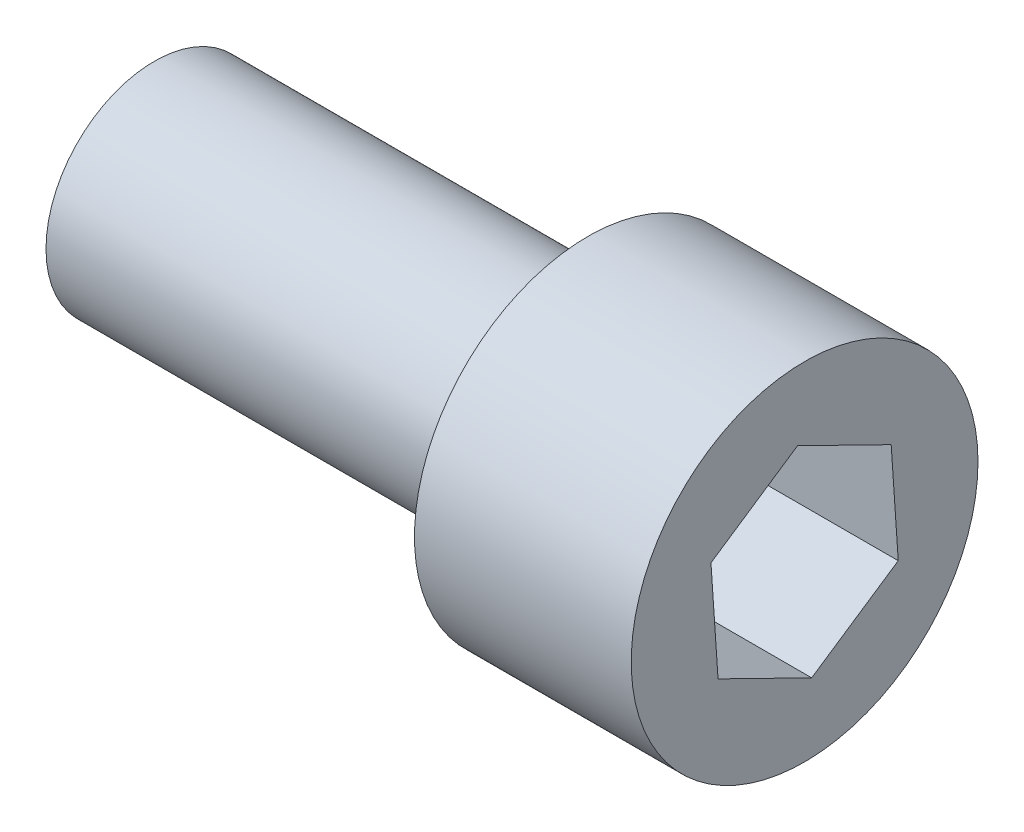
ISO-10303-21;
HEADER;
FILE_DESCRIPTION(('STEP AP214'),'2;1');
FILE_NAME('part.step','',(''),(''),'','','');
FILE_SCHEMA(('AUTOMOTIVE_DESIGN { 1 0 10303 214 1 1 1 1 }'));
ENDSEC;
DATA;
#1=APPLICATION_CONTEXT('core data for automotive mechanical design processes');
#2=APPLICATION_PROTOCOL_DEFINITION('international standard','automotive_design',2000,#1);
#3=PRODUCT_CONTEXT('',#1,'mechanical');
#4=PRODUCT('Part','Part','',(#3));
#5=PRODUCT_RELATED_PRODUCT_CATEGORY('part','',(#4));
#6=PRODUCT_DEFINITION_FORMATION('','',#4);
#7=PRODUCT_DEFINITION_CONTEXT('part definition',#1,'design');
#8=PRODUCT_DEFINITION('design','',#6,#7);
#9=PRODUCT_DEFINITION_SHAPE('','',#8);
#10=(LENGTH_UNIT() NAMED_UNIT(*) SI_UNIT(.MILLI.,.METRE.));
#11=(NAMED_UNIT(*) PLANE_ANGLE_UNIT() SI_UNIT($,.RADIAN.));
#12=(NAMED_UNIT(*) SI_UNIT($,.STERADIAN.) SOLID_ANGLE_UNIT());
#13=UNCERTAINTY_MEASURE_WITH_UNIT(LENGTH_MEASURE(1.E-05),#10,'distance_accuracy_value','');
#14=(GEOMETRIC_REPRESENTATION_CONTEXT(3) GLOBAL_UNCERTAINTY_ASSIGNED_CONTEXT((#13)) GLOBAL_UNIT_ASSIGNED_CONTEXT((#10,
#11,#12)) REPRESENTATION_CONTEXT('',''));
#15=CARTESIAN_POINT('',(0.,0.,0.));
#16=DIRECTION('',(0.,0.,1.));
#17=DIRECTION('',(1.,0.,0.));
#18=AXIS2_PLACEMENT_3D('',#15,#16,#17);
#19=CARTESIAN_POINT('',(0.,0.,0.));
#20=DIRECTION('',(1.,0.,0.));
#21=DIRECTION('',(0.,0.,-0.999999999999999));
#22=AXIS2_PLACEMENT_3D('',#19,#20,#21);
#23=PLANE('',#22);
#24=DIRECTION('',(0.,0.557571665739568,-0.830128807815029));
#25=VECTOR('',#24,1.);
#26=CARTESIAN_POINT('',(0.,-1.44005369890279,-0.0978707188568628));
#27=LINE('',#26,#25);
#28=CARTESIAN_POINT('',(0.,-1.44005369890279,-0.0978707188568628));
#29=VERTEX_POINT('',#28);
#30=CARTESIAN_POINT('',(0.,-0.635268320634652,-1.29605844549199));
#31=VERTEX_POINT('',#30);
#32=EDGE_CURVE('E51',#29,#31,#27,.T.);
#33=ORIENTED_EDGE('',*,*,#32,.F.);
#34=DIRECTION('',(0.,-0.440126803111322,-0.897935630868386));
#35=VECTOR('',#34,1.);
#36=CARTESIAN_POINT('',(0.,-0.80478537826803,1.19818772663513));
#37=LINE('',#36,#35);
#38=CARTESIAN_POINT('',(0.,-0.80478537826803,1.19818772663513));
#39=VERTEX_POINT('',#38);
#40=EDGE_CURVE('E134',#39,#29,#37,.T.);
#41=ORIENTED_EDGE('',*,*,#40,.F.);
#42=DIRECTION('',(0.,-0.99769846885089,-0.0678068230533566));
#43=VECTOR('',#42,1.);
#44=CARTESIAN_POINT('',(0.,0.635268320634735,1.29605844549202));
#45=LINE('',#44,#43);
#46=CARTESIAN_POINT('',(0.,0.635268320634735,1.29605844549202));
#47=VERTEX_POINT('',#46);
#48=EDGE_CURVE('E132',#47,#39,#45,.T.);
#49=ORIENTED_EDGE('',*,*,#48,.F.);
#50=DIRECTION('',(0.,-0.557571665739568,0.830128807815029));
#51=VECTOR('',#50,1.);
#52=CARTESIAN_POINT('',(0.,1.44005369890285,0.0978707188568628));
#53=LINE('',#52,#51);
#54=CARTESIAN_POINT('',(0.,1.44005369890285,0.0978707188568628));
#55=VERTEX_POINT('',#54);
#56=EDGE_CURVE('E99',#55,#47,#53,.T.);
#57=ORIENTED_EDGE('',*,*,#56,.F.);
#58=DIRECTION('',(0.,0.440126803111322,0.897935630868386));
#59=VECTOR('',#58,1.);
#60=CARTESIAN_POINT('',(0.,0.804785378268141,-1.19818772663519));
#61=LINE('',#60,#59);
#62=CARTESIAN_POINT('',(0.,0.804785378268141,-1.19818772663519));
#63=VERTEX_POINT('',#62);
#64=EDGE_CURVE('E128',#63,#55,#61,.T.);
#65=ORIENTED_EDGE('',*,*,#64,.F.);
#66=DIRECTION('',(0.,0.99769846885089,0.0678068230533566));
#67=VECTOR('',#66,1.);
#68=CARTESIAN_POINT('',(0.,-0.635268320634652,-1.29605844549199));
#69=LINE('',#68,#67);
#70=EDGE_CURVE('E125',#31,#63,#69,.T.);
#71=ORIENTED_EDGE('',*,*,#70,.F.);
#72=EDGE_LOOP('',(#33,#41,#49,#57,#65,#71));
#73=FACE_BOUND('',#72,.T.);
#74=CARTESIAN_POINT('',(0.,0.,0.));
#75=DIRECTION('',(1.,0.,0.));
#76=DIRECTION('',(0.,0.,-0.999999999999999));
#77=AXIS2_PLACEMENT_3D('',#74,#75,#76);
#78=CIRCLE('',#77,2.4);
#79=CARTESIAN_POINT('',(0.,0.,-2.4));
#80=VERTEX_POINT('',#79);
#81=EDGE_CURVE('E11',#80,#80,#78,.T.);
#82=ORIENTED_EDGE('',*,*,#81,.T.);
#83=EDGE_LOOP('',(#82));
#84=FACE_BOUND('',#83,.T.);
#85=ADVANCED_FACE('F37',(#73,#84),#23,.T.);
#86=CARTESIAN_POINT('',(0.,0.,0.));
#87=DIRECTION('',(1.,0.,0.));
#88=DIRECTION('',(0.,0.,-0.999999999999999));
#89=AXIS2_PLACEMENT_3D('',#86,#87,#88);
#90=CYLINDRICAL_SURFACE('',#89,2.4);
#91=CARTESIAN_POINT('',(-3.00000000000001,0.,0.));
#92=DIRECTION('',(1.,0.,0.));
#93=DIRECTION('',(0.,0.,-0.999999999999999));
#94=AXIS2_PLACEMENT_3D('',#91,#92,#93);
#95=CIRCLE('',#94,2.4);
#96=CARTESIAN_POINT('',(-3.00000000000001,0.,-2.4));
#97=VERTEX_POINT('',#96);
#98=EDGE_CURVE('E44',#97,#97,#95,.T.);
#99=ORIENTED_EDGE('',*,*,#98,.T.);
#100=EDGE_LOOP('',(#99));
#101=FACE_BOUND('',#100,.T.);
#102=ORIENTED_EDGE('',*,*,#81,.F.);
#103=EDGE_LOOP('',(#102));
#104=FACE_BOUND('',#103,.T.);
#105=ADVANCED_FACE('F151',(#101,#104),#90,.T.);
#106=CARTESIAN_POINT('',(-3.00000000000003,2.40000000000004,0.));
#107=DIRECTION('',(-1.,0.,0.));
#108=DIRECTION('',(0.,0.,0.999999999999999));
#109=AXIS2_PLACEMENT_3D('',#106,#107,#108);
#110=PLANE('',#109);
#111=CARTESIAN_POINT('',(-3.00000000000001,0.,0.));
#112=DIRECTION('',(1.,0.,0.));
#113=DIRECTION('',(0.,0.,-0.999999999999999));
#114=AXIS2_PLACEMENT_3D('',#111,#112,#113);
#115=CIRCLE('',#114,1.5);
#116=CARTESIAN_POINT('',(-3.00000000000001,0.,-1.5));
#117=VERTEX_POINT('',#116);
#118=EDGE_CURVE('E146',#117,#117,#115,.T.);
#119=ORIENTED_EDGE('',*,*,#118,.T.);
#120=EDGE_LOOP('',(#119));
#121=FACE_BOUND('',#120,.T.);
#122=ORIENTED_EDGE('',*,*,#98,.F.);
#123=EDGE_LOOP('',(#122));
#124=FACE_BOUND('',#123,.T.);
#125=ADVANCED_FACE('F154',(#121,#124),#110,.T.);
#126=CARTESIAN_POINT('',(0.,0.,0.));
#127=DIRECTION('',(1.,0.,0.));
#128=DIRECTION('',(0.,0.,-0.999999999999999));
#129=AXIS2_PLACEMENT_3D('',#126,#127,#128);
#130=CYLINDRICAL_SURFACE('',#129,1.5);
#131=CARTESIAN_POINT('',(-9.00000000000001,0.,0.));
#132=DIRECTION('',(1.,0.,0.));
#133=DIRECTION('',(0.,0.,-0.999999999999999));
#134=AXIS2_PLACEMENT_3D('',#131,#132,#133);
#135=CIRCLE('',#134,1.5);
#136=CARTESIAN_POINT('',(-9.00000000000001,0.,-1.5));
#137=VERTEX_POINT('',#136);
#138=EDGE_CURVE('E138',#137,#137,#135,.T.);
#139=ORIENTED_EDGE('',*,*,#138,.T.);
#140=EDGE_LOOP('',(#139));
#141=FACE_BOUND('',#140,.T.);
#142=ORIENTED_EDGE('',*,*,#118,.F.);
#143=EDGE_LOOP('',(#142));
#144=FACE_BOUND('',#143,.T.);
#145=ADVANCED_FACE('F156',(#141,#144),#130,.T.);
#146=CARTESIAN_POINT('',(-9.00000000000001,1.50000000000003,0.));
#147=DIRECTION('',(-1.,0.,0.));
#148=DIRECTION('',(0.,0.,0.999999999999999));
#149=AXIS2_PLACEMENT_3D('',#146,#147,#148);
#150=PLANE('',#149);
#151=ORIENTED_EDGE('',*,*,#138,.F.);
#152=EDGE_LOOP('',(#151));
#153=FACE_BOUND('',#152,.T.);
#154=ADVANCED_FACE('F163',(#153),#150,.T.);
#155=CARTESIAN_POINT('',(-2.,-1.44005369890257,-0.097870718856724));
#156=DIRECTION('',(0.,-0.83012880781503,-0.557571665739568));
#157=DIRECTION('',(0.,0.557571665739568,-0.830128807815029));
#158=AXIS2_PLACEMENT_3D('',#155,#156,#157);
#159=PLANE('',#158);
#160=ORIENTED_EDGE('',*,*,#32,.T.);
#161=DIRECTION('',(1.,0.,0.));
#162=VECTOR('',#161,1.);
#163=CARTESIAN_POINT('',(-2.,-0.635268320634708,-1.29605844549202));
#164=LINE('',#163,#162);
#165=CARTESIAN_POINT('',(-2.,-0.635268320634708,-1.29605844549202));
#166=VERTEX_POINT('',#165);
#167=EDGE_CURVE('E81',#166,#31,#164,.T.);
#168=ORIENTED_EDGE('',*,*,#167,.F.);
#169=DIRECTION('',(0.,0.557571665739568,-0.830128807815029));
#170=VECTOR('',#169,1.);
#171=CARTESIAN_POINT('',(-2.,-1.44005369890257,-0.097870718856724));
#172=LINE('',#171,#170);
#173=CARTESIAN_POINT('',(-2.,-1.44005369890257,-0.097870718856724));
#174=VERTEX_POINT('',#173);
#175=EDGE_CURVE('E136',#174,#166,#172,.T.);
#176=ORIENTED_EDGE('',*,*,#175,.F.);
#177=DIRECTION('',(1.,0.,0.));
#178=VECTOR('',#177,1.);
#179=CARTESIAN_POINT('',(-2.,-1.44005369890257,-0.097870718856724));
#180=LINE('',#179,#178);
#181=EDGE_CURVE('E59',#174,#29,#180,.T.);
#182=ORIENTED_EDGE('',*,*,#181,.T.);
#183=EDGE_LOOP('',(#160,#168,#176,#182));
#184=FACE_BOUND('',#183,.T.);
#185=ADVANCED_FACE('F178',(#184),#159,.F.);
#186=CARTESIAN_POINT('',(-2.,-0.804785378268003,1.19818772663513));
#187=DIRECTION('',(0.,-0.897935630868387,0.440126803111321));
#188=DIRECTION('',(0.,-0.440126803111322,-0.897935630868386));
#189=AXIS2_PLACEMENT_3D('',#186,#187,#188);
#190=PLANE('',#189);
#191=ORIENTED_EDGE('',*,*,#40,.T.);
#192=ORIENTED_EDGE('',*,*,#181,.F.);
#193=DIRECTION('',(0.,-0.440126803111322,-0.897935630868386));
#194=VECTOR('',#193,1.);
#195=CARTESIAN_POINT('',(-2.,-0.804785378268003,1.19818772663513));
#196=LINE('',#195,#194);
#197=CARTESIAN_POINT('',(-2.,-0.804785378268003,1.19818772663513));
#198=VERTEX_POINT('',#197);
#199=EDGE_CURVE('E111',#198,#174,#196,.T.);
#200=ORIENTED_EDGE('',*,*,#199,.F.);
#201=DIRECTION('',(1.,0.,0.));
#202=VECTOR('',#201,1.);
#203=CARTESIAN_POINT('',(-2.,-0.804785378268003,1.19818772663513));
#204=LINE('',#203,#202);
#205=EDGE_CURVE('E103',#198,#39,#204,.T.);
#206=ORIENTED_EDGE('',*,*,#205,.T.);
#207=EDGE_LOOP('',(#191,#192,#200,#206));
#208=FACE_BOUND('',#207,.T.);
#209=ADVANCED_FACE('F180',(#208),#190,.F.);
#210=CARTESIAN_POINT('',(-2.,0.635268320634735,1.29605844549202));
#211=DIRECTION('',(0.,-0.0678068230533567,0.997698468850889));
#212=DIRECTION('',(0.,-0.99769846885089,-0.0678068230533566));
#213=AXIS2_PLACEMENT_3D('',#210,#211,#212);
#214=PLANE('',#213);
#215=ORIENTED_EDGE('',*,*,#48,.T.);
#216=ORIENTED_EDGE('',*,*,#205,.F.);
#217=DIRECTION('',(0.,-0.99769846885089,-0.0678068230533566));
#218=VECTOR('',#217,1.);
#219=CARTESIAN_POINT('',(-2.,0.635268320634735,1.29605844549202));
#220=LINE('',#219,#218);
#221=CARTESIAN_POINT('',(-2.,0.635268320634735,1.29605844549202));
#222=VERTEX_POINT('',#221);
#223=EDGE_CURVE('E107',#222,#198,#220,.T.);
#224=ORIENTED_EDGE('',*,*,#223,.F.);
#225=DIRECTION('',(1.,0.,0.));
#226=VECTOR('',#225,1.);
#227=CARTESIAN_POINT('',(-2.,0.635268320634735,1.29605844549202));
#228=LINE('',#227,#226);
#229=EDGE_CURVE('E92',#222,#47,#228,.T.);
#230=ORIENTED_EDGE('',*,*,#229,.T.);
#231=EDGE_LOOP('',(#215,#216,#224,#230));
#232=FACE_BOUND('',#231,.T.);
#233=ADVANCED_FACE('F108',(#232),#214,.F.);
#234=CARTESIAN_POINT('',(-2.,1.44005369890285,0.0978707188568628));
#235=DIRECTION('',(0.,0.83012880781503,0.557571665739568));
#236=DIRECTION('',(0.,-0.557571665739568,0.830128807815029));
#237=AXIS2_PLACEMENT_3D('',#234,#235,#236);
#238=PLANE('',#237);
#239=ORIENTED_EDGE('',*,*,#56,.T.);
#240=ORIENTED_EDGE('',*,*,#229,.F.);
#241=DIRECTION('',(0.,-0.557571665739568,0.830128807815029));
#242=VECTOR('',#241,1.);
#243=CARTESIAN_POINT('',(-2.,1.44005369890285,0.0978707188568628));
#244=LINE('',#243,#242);
#245=CARTESIAN_POINT('',(-2.,1.44005369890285,0.0978707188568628));
#246=VERTEX_POINT('',#245);
#247=EDGE_CURVE('E96',#246,#222,#244,.T.);
#248=ORIENTED_EDGE('',*,*,#247,.F.);
#249=DIRECTION('',(1.,0.,0.));
#250=VECTOR('',#249,1.);
#251=CARTESIAN_POINT('',(-2.,1.44005369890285,0.0978707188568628));
#252=LINE('',#251,#250);
#253=EDGE_CURVE('E104',#246,#55,#252,.T.);
#254=ORIENTED_EDGE('',*,*,#253,.T.);
#255=EDGE_LOOP('',(#239,#240,#248,#254));
#256=FACE_BOUND('',#255,.T.);
#257=ADVANCED_FACE('F94',(#256),#238,.F.);
#258=CARTESIAN_POINT('',(-2.,0.804785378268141,-1.19818772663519));
#259=DIRECTION('',(0.,0.897935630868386,-0.440126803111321));
#260=DIRECTION('',(0.,0.440126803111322,0.897935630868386));
#261=AXIS2_PLACEMENT_3D('',#258,#259,#260);
#262=PLANE('',#261);
#263=ORIENTED_EDGE('',*,*,#64,.T.);
#264=ORIENTED_EDGE('',*,*,#253,.F.);
#265=DIRECTION('',(0.,0.440126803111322,0.897935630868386));
#266=VECTOR('',#265,1.);
#267=CARTESIAN_POINT('',(-2.,0.804785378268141,-1.19818772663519));
#268=LINE('',#267,#266);
#269=CARTESIAN_POINT('',(-2.,0.804785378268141,-1.19818772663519));
#270=VERTEX_POINT('',#269);
#271=EDGE_CURVE('E117',#270,#246,#268,.T.);
#272=ORIENTED_EDGE('',*,*,#271,.F.);
#273=DIRECTION('',(1.,0.,0.));
#274=VECTOR('',#273,1.);
#275=CARTESIAN_POINT('',(-2.,0.804785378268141,-1.19818772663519));
#276=LINE('',#275,#274);
#277=EDGE_CURVE('E141',#270,#63,#276,.T.);
#278=ORIENTED_EDGE('',*,*,#277,.T.);
#279=EDGE_LOOP('',(#263,#264,#272,#278));
#280=FACE_BOUND('',#279,.T.);
#281=ADVANCED_FACE('F192',(#280),#262,.F.);
#282=CARTESIAN_POINT('',(-2.,-0.635268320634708,-1.29605844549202));
#283=DIRECTION('',(0.,0.0678068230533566,-0.997698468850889));
#284=DIRECTION('',(0.,0.99769846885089,0.0678068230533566));
#285=AXIS2_PLACEMENT_3D('',#282,#283,#284);
#286=PLANE('',#285);
#287=ORIENTED_EDGE('',*,*,#70,.T.);
#288=ORIENTED_EDGE('',*,*,#277,.F.);
#289=DIRECTION('',(0.,0.99769846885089,0.0678068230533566));
#290=VECTOR('',#289,1.);
#291=CARTESIAN_POINT('',(-2.,-0.635268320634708,-1.29605844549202));
#292=LINE('',#291,#290);
#293=EDGE_CURVE('E119',#166,#270,#292,.T.);
#294=ORIENTED_EDGE('',*,*,#293,.F.);
#295=ORIENTED_EDGE('',*,*,#167,.T.);
#296=EDGE_LOOP('',(#287,#288,#294,#295));
#297=FACE_BOUND('',#296,.T.);
#298=ADVANCED_FACE('F176',(#297),#286,.F.);
#299=CARTESIAN_POINT('',(-2.,-0.635268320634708,-1.29605844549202));
#300=DIRECTION('',(1.,0.,0.));
#301=DIRECTION('',(0.,0.,-0.999999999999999));
#302=AXIS2_PLACEMENT_3D('',#299,#300,#301);
#303=PLANE('',#302);
#304=ORIENTED_EDGE('',*,*,#175,.T.);
#305=ORIENTED_EDGE('',*,*,#293,.T.);
#306=ORIENTED_EDGE('',*,*,#271,.T.);
#307=ORIENTED_EDGE('',*,*,#247,.T.);
#308=ORIENTED_EDGE('',*,*,#223,.T.);
#309=ORIENTED_EDGE('',*,*,#199,.T.);
#310=EDGE_LOOP('',(#304,#305,#306,#307,#308,#309));
#311=FACE_BOUND('',#310,.T.);
#312=ADVANCED_FACE('F114',(#311),#303,.T.);
#313=CLOSED_SHELL('',(#85,#105,#125,#145,#154,#185,#209,#233,#257,#281,#298,#312));
#314=MANIFOLD_SOLID_BREP('B2',#313);
#315=ADVANCED_BREP_SHAPE_REPRESENTATION('',(#18,#314),#14);
#316=SHAPE_DEFINITION_REPRESENTATION(#9,#315);
ENDSEC;
END-ISO-10303-21;
